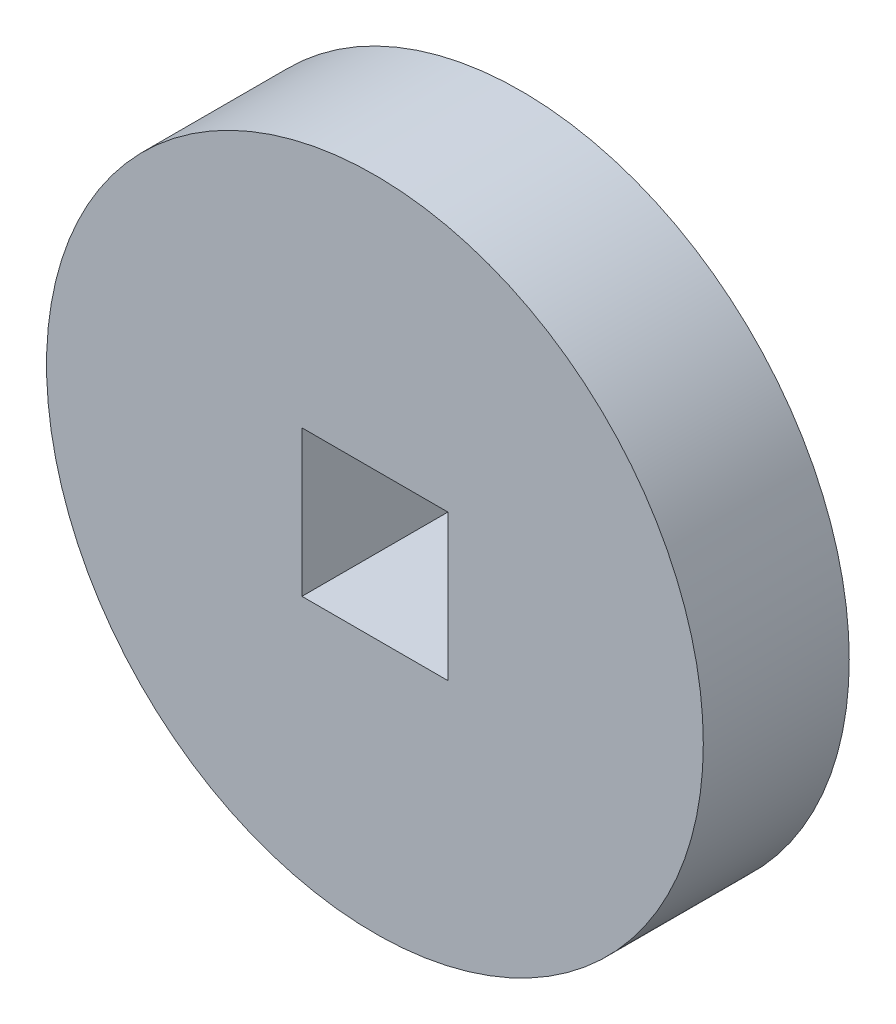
ISO-10303-21;
HEADER;
FILE_DESCRIPTION(('STEP AP214'),'2;1');
FILE_NAME('part.step','',(''),(''),'','','');
FILE_SCHEMA(('AUTOMOTIVE_DESIGN { 1 0 10303 214 1 1 1 1 }'));
ENDSEC;
DATA;
#1=APPLICATION_CONTEXT('core data for automotive mechanical design processes');
#2=APPLICATION_PROTOCOL_DEFINITION('international standard','automotive_design',2000,#1);
#3=PRODUCT_CONTEXT('',#1,'mechanical');
#4=PRODUCT('Part','Part','',(#3));
#5=PRODUCT_RELATED_PRODUCT_CATEGORY('part','',(#4));
#6=PRODUCT_DEFINITION_FORMATION('','',#4);
#7=PRODUCT_DEFINITION_CONTEXT('part definition',#1,'design');
#8=PRODUCT_DEFINITION('design','',#6,#7);
#9=PRODUCT_DEFINITION_SHAPE('','',#8);
#10=(LENGTH_UNIT() NAMED_UNIT(*) SI_UNIT(.MILLI.,.METRE.));
#11=(NAMED_UNIT(*) PLANE_ANGLE_UNIT() SI_UNIT($,.RADIAN.));
#12=(NAMED_UNIT(*) SI_UNIT($,.STERADIAN.) SOLID_ANGLE_UNIT());
#13=UNCERTAINTY_MEASURE_WITH_UNIT(LENGTH_MEASURE(1.E-05),#10,'distance_accuracy_value','');
#14=(GEOMETRIC_REPRESENTATION_CONTEXT(3) GLOBAL_UNCERTAINTY_ASSIGNED_CONTEXT((#13)) GLOBAL_UNIT_ASSIGNED_CONTEXT((#10,
#11,#12)) REPRESENTATION_CONTEXT('',''));
#15=CARTESIAN_POINT('',(0.,0.,0.));
#16=DIRECTION('',(0.,0.,1.));
#17=DIRECTION('',(1.,0.,0.));
#18=AXIS2_PLACEMENT_3D('',#15,#16,#17);
#19=CARTESIAN_POINT('',(0.,0.,6.35));
#20=DIRECTION('',(0.,0.,1.));
#21=DIRECTION('',(1.,0.,0.));
#22=AXIS2_PLACEMENT_3D('',#19,#20,#21);
#23=PLANE('',#22);
#24=CARTESIAN_POINT('',(0.,0.,6.35));
#25=DIRECTION('',(0.,0.,1.));
#26=DIRECTION('',(1.,0.,0.));
#27=AXIS2_PLACEMENT_3D('',#24,#25,#26);
#28=CIRCLE('',#27,14.2875);
#29=CARTESIAN_POINT('',(14.2875,0.,6.35));
#30=VERTEX_POINT('',#29);
#31=EDGE_CURVE('E13',#30,#30,#28,.T.);
#32=ORIENTED_EDGE('',*,*,#31,.T.);
#33=EDGE_LOOP('',(#32));
#34=FACE_BOUND('',#33,.T.);
#35=DIRECTION('',(-1.,0.,0.));
#36=VECTOR('',#35,1.);
#37=CARTESIAN_POINT('',(-3.175,3.175,6.35));
#38=LINE('',#37,#36);
#39=CARTESIAN_POINT('',(3.175,3.175,6.35));
#40=VERTEX_POINT('',#39);
#41=CARTESIAN_POINT('',(-3.175,3.175,6.35));
#42=VERTEX_POINT('',#41);
#43=EDGE_CURVE('E91',#40,#42,#38,.T.);
#44=ORIENTED_EDGE('',*,*,#43,.F.);
#45=DIRECTION('',(0.,1.,0.));
#46=VECTOR('',#45,1.);
#47=CARTESIAN_POINT('',(3.175,3.175,6.35));
#48=LINE('',#47,#46);
#49=CARTESIAN_POINT('',(3.175,-3.175,6.35));
#50=VERTEX_POINT('',#49);
#51=EDGE_CURVE('E83',#50,#40,#48,.T.);
#52=ORIENTED_EDGE('',*,*,#51,.F.);
#53=DIRECTION('',(1.,0.,0.));
#54=VECTOR('',#53,1.);
#55=CARTESIAN_POINT('',(-3.175,-3.175,6.35));
#56=LINE('',#55,#54);
#57=CARTESIAN_POINT('',(-3.175,-3.175,6.35));
#58=VERTEX_POINT('',#57);
#59=EDGE_CURVE('E104',#58,#50,#56,.T.);
#60=ORIENTED_EDGE('',*,*,#59,.F.);
#61=DIRECTION('',(0.,-1.,0.));
#62=VECTOR('',#61,1.);
#63=CARTESIAN_POINT('',(-3.175,3.175,6.35));
#64=LINE('',#63,#62);
#65=EDGE_CURVE('E102',#42,#58,#64,.T.);
#66=ORIENTED_EDGE('',*,*,#65,.F.);
#67=EDGE_LOOP('',(#44,#52,#60,#66));
#68=FACE_BOUND('',#67,.T.);
#69=ADVANCED_FACE('F42',(#34,#68),#23,.T.);
#70=CARTESIAN_POINT('',(0.,0.,0.));
#71=DIRECTION('',(0.,0.,1.));
#72=DIRECTION('',(1.,0.,0.));
#73=AXIS2_PLACEMENT_3D('',#70,#71,#72);
#74=PLANE('',#73);
#75=CARTESIAN_POINT('',(0.,0.,0.));
#76=DIRECTION('',(0.,0.,1.));
#77=DIRECTION('',(1.,0.,0.));
#78=AXIS2_PLACEMENT_3D('',#75,#76,#77);
#79=CIRCLE('',#78,14.2875);
#80=CARTESIAN_POINT('',(14.2875,0.,0.));
#81=VERTEX_POINT('',#80);
#82=EDGE_CURVE('E46',#81,#81,#79,.T.);
#83=ORIENTED_EDGE('',*,*,#82,.F.);
#84=EDGE_LOOP('',(#83));
#85=FACE_BOUND('',#84,.T.);
#86=DIRECTION('',(0.,1.,0.));
#87=VECTOR('',#86,1.);
#88=CARTESIAN_POINT('',(3.175,3.175,0.));
#89=LINE('',#88,#87);
#90=CARTESIAN_POINT('',(3.175,-3.175,0.));
#91=VERTEX_POINT('',#90);
#92=CARTESIAN_POINT('',(3.175,3.175,0.));
#93=VERTEX_POINT('',#92);
#94=EDGE_CURVE('E65',#91,#93,#89,.T.);
#95=ORIENTED_EDGE('',*,*,#94,.T.);
#96=DIRECTION('',(-1.,0.,0.));
#97=VECTOR('',#96,1.);
#98=CARTESIAN_POINT('',(-3.175,3.175,0.));
#99=LINE('',#98,#97);
#100=CARTESIAN_POINT('',(-3.175,3.175,0.));
#101=VERTEX_POINT('',#100);
#102=EDGE_CURVE('E98',#93,#101,#99,.T.);
#103=ORIENTED_EDGE('',*,*,#102,.T.);
#104=DIRECTION('',(0.,-1.,0.));
#105=VECTOR('',#104,1.);
#106=CARTESIAN_POINT('',(-3.175,3.175,0.));
#107=LINE('',#106,#105);
#108=CARTESIAN_POINT('',(-3.175,-3.175,0.));
#109=VERTEX_POINT('',#108);
#110=EDGE_CURVE('E110',#101,#109,#107,.T.);
#111=ORIENTED_EDGE('',*,*,#110,.T.);
#112=DIRECTION('',(1.,0.,0.));
#113=VECTOR('',#112,1.);
#114=CARTESIAN_POINT('',(-3.175,-3.175,0.));
#115=LINE('',#114,#113);
#116=EDGE_CURVE('E92',#109,#91,#115,.T.);
#117=ORIENTED_EDGE('',*,*,#116,.T.);
#118=EDGE_LOOP('',(#95,#103,#111,#117));
#119=FACE_BOUND('',#118,.T.);
#120=ADVANCED_FACE('F121',(#85,#119),#74,.F.);
#121=CARTESIAN_POINT('',(0.,0.,6.35));
#122=DIRECTION('',(0.,0.,-1.));
#123=DIRECTION('',(-1.,0.,0.));
#124=AXIS2_PLACEMENT_3D('',#121,#122,#123);
#125=CYLINDRICAL_SURFACE('',#124,14.2875);
#126=ORIENTED_EDGE('',*,*,#31,.F.);
#127=EDGE_LOOP('',(#126));
#128=FACE_BOUND('',#127,.T.);
#129=ORIENTED_EDGE('',*,*,#82,.T.);
#130=EDGE_LOOP('',(#129));
#131=FACE_BOUND('',#130,.T.);
#132=ADVANCED_FACE('F44',(#128,#131),#125,.T.);
#133=CARTESIAN_POINT('',(3.175,3.175,6.35));
#134=DIRECTION('',(-1.,0.,0.));
#135=DIRECTION('',(0.,-1.,0.));
#136=AXIS2_PLACEMENT_3D('',#133,#134,#135);
#137=PLANE('',#136);
#138=ORIENTED_EDGE('',*,*,#94,.F.);
#139=DIRECTION('',(0.,0.,-1.));
#140=VECTOR('',#139,1.);
#141=CARTESIAN_POINT('',(3.175,-3.175,6.35));
#142=LINE('',#141,#140);
#143=EDGE_CURVE('E87',#50,#91,#142,.T.);
#144=ORIENTED_EDGE('',*,*,#143,.F.);
#145=ORIENTED_EDGE('',*,*,#51,.T.);
#146=DIRECTION('',(0.,0.,-1.));
#147=VECTOR('',#146,1.);
#148=CARTESIAN_POINT('',(3.175,3.175,6.35));
#149=LINE('',#148,#147);
#150=EDGE_CURVE('E86',#40,#93,#149,.T.);
#151=ORIENTED_EDGE('',*,*,#150,.T.);
#152=EDGE_LOOP('',(#138,#144,#145,#151));
#153=FACE_BOUND('',#152,.T.);
#154=ADVANCED_FACE('F85',(#153),#137,.T.);
#155=CARTESIAN_POINT('',(-3.175,3.175,6.35));
#156=DIRECTION('',(0.,-1.,0.));
#157=DIRECTION('',(0.,0.,-1.));
#158=AXIS2_PLACEMENT_3D('',#155,#156,#157);
#159=PLANE('',#158);
#160=ORIENTED_EDGE('',*,*,#102,.F.);
#161=ORIENTED_EDGE('',*,*,#150,.F.);
#162=ORIENTED_EDGE('',*,*,#43,.T.);
#163=DIRECTION('',(0.,0.,-1.));
#164=VECTOR('',#163,1.);
#165=CARTESIAN_POINT('',(-3.175,3.175,6.35));
#166=LINE('',#165,#164);
#167=EDGE_CURVE('E99',#42,#101,#166,.T.);
#168=ORIENTED_EDGE('',*,*,#167,.T.);
#169=EDGE_LOOP('',(#160,#161,#162,#168));
#170=FACE_BOUND('',#169,.T.);
#171=ADVANCED_FACE('F95',(#170),#159,.T.);
#172=CARTESIAN_POINT('',(-3.175,3.175,6.35));
#173=DIRECTION('',(1.,0.,0.));
#174=DIRECTION('',(0.,1.,0.));
#175=AXIS2_PLACEMENT_3D('',#172,#173,#174);
#176=PLANE('',#175);
#177=ORIENTED_EDGE('',*,*,#110,.F.);
#178=ORIENTED_EDGE('',*,*,#167,.F.);
#179=ORIENTED_EDGE('',*,*,#65,.T.);
#180=DIRECTION('',(0.,0.,-1.));
#181=VECTOR('',#180,1.);
#182=CARTESIAN_POINT('',(-3.175,-3.175,6.35));
#183=LINE('',#182,#181);
#184=EDGE_CURVE('E57',#58,#109,#183,.T.);
#185=ORIENTED_EDGE('',*,*,#184,.T.);
#186=EDGE_LOOP('',(#177,#178,#179,#185));
#187=FACE_BOUND('',#186,.T.);
#188=ADVANCED_FACE('F119',(#187),#176,.T.);
#189=CARTESIAN_POINT('',(-3.175,-3.175,6.35));
#190=DIRECTION('',(0.,1.,0.));
#191=DIRECTION('',(0.,0.,1.));
#192=AXIS2_PLACEMENT_3D('',#189,#190,#191);
#193=PLANE('',#192);
#194=ORIENTED_EDGE('',*,*,#116,.F.);
#195=ORIENTED_EDGE('',*,*,#184,.F.);
#196=ORIENTED_EDGE('',*,*,#59,.T.);
#197=ORIENTED_EDGE('',*,*,#143,.T.);
#198=EDGE_LOOP('',(#194,#195,#196,#197));
#199=FACE_BOUND('',#198,.T.);
#200=ADVANCED_FACE('F122',(#199),#193,.T.);
#201=CLOSED_SHELL('',(#69,#120,#132,#154,#171,#188,#200));
#202=MANIFOLD_SOLID_BREP('B2',#201);
#203=ADVANCED_BREP_SHAPE_REPRESENTATION('',(#18,#202),#14);
#204=SHAPE_DEFINITION_REPRESENTATION(#9,#203);
ENDSEC;
END-ISO-10303-21;
